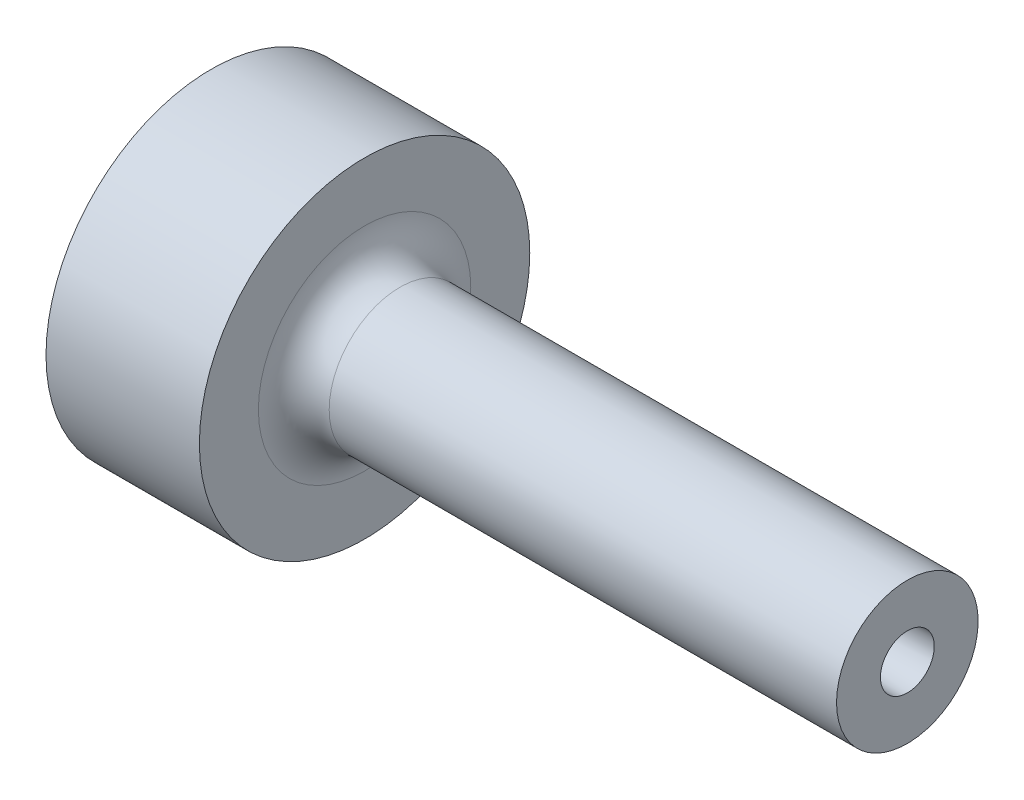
ISO-10303-21;
HEADER;
FILE_DESCRIPTION(('STEP AP214'),'2;1');
FILE_NAME('part.step','',(''),(''),'','','');
FILE_SCHEMA(('AUTOMOTIVE_DESIGN { 1 0 10303 214 1 1 1 1 }'));
ENDSEC;
DATA;
#1=APPLICATION_CONTEXT('core data for automotive mechanical design processes');
#2=APPLICATION_PROTOCOL_DEFINITION('international standard','automotive_design',2000,#1);
#3=PRODUCT_CONTEXT('',#1,'mechanical');
#4=PRODUCT('Part','Part','',(#3));
#5=PRODUCT_RELATED_PRODUCT_CATEGORY('part','',(#4));
#6=PRODUCT_DEFINITION_FORMATION('','',#4);
#7=PRODUCT_DEFINITION_CONTEXT('part definition',#1,'design');
#8=PRODUCT_DEFINITION('design','',#6,#7);
#9=PRODUCT_DEFINITION_SHAPE('','',#8);
#10=(LENGTH_UNIT() NAMED_UNIT(*) SI_UNIT(.MILLI.,.METRE.));
#11=(NAMED_UNIT(*) PLANE_ANGLE_UNIT() SI_UNIT($,.RADIAN.));
#12=(NAMED_UNIT(*) SI_UNIT($,.STERADIAN.) SOLID_ANGLE_UNIT());
#13=UNCERTAINTY_MEASURE_WITH_UNIT(LENGTH_MEASURE(1.E-05),#10,'distance_accuracy_value','');
#14=(GEOMETRIC_REPRESENTATION_CONTEXT(3) GLOBAL_UNCERTAINTY_ASSIGNED_CONTEXT((#13)) GLOBAL_UNIT_ASSIGNED_CONTEXT((#10,
#11,#12)) REPRESENTATION_CONTEXT('',''));
#15=CARTESIAN_POINT('',(0.,0.,0.));
#16=DIRECTION('',(0.,0.,1.));
#17=DIRECTION('',(1.,0.,0.));
#18=AXIS2_PLACEMENT_3D('',#15,#16,#17);
#19=CARTESIAN_POINT('',(0.,0.,0.));
#20=DIRECTION('',(-1.,0.,0.));
#21=DIRECTION('',(0.,0.,1.));
#22=AXIS2_PLACEMENT_3D('',#19,#20,#21);
#23=CYLINDRICAL_SURFACE('',#22,14.);
#24=CARTESIAN_POINT('',(13.,0.,0.));
#25=DIRECTION('',(-1.,0.,0.));
#26=DIRECTION('',(0.,0.,1.));
#27=AXIS2_PLACEMENT_3D('',#24,#25,#26);
#28=CIRCLE('',#27,14.);
#29=CARTESIAN_POINT('',(13.,0.,14.));
#30=VERTEX_POINT('',#29);
#31=EDGE_CURVE('E89',#30,#30,#28,.T.);
#32=ORIENTED_EDGE('',*,*,#31,.T.);
#33=EDGE_LOOP('',(#32));
#34=FACE_BOUND('',#33,.T.);
#35=CARTESIAN_POINT('',(0.,0.,0.));
#36=DIRECTION('',(-1.,0.,0.));
#37=DIRECTION('',(0.,0.,1.));
#38=AXIS2_PLACEMENT_3D('',#35,#36,#37);
#39=CIRCLE('',#38,14.);
#40=CARTESIAN_POINT('',(0.,0.,14.));
#41=VERTEX_POINT('',#40);
#42=EDGE_CURVE('E84',#41,#41,#39,.T.);
#43=ORIENTED_EDGE('',*,*,#42,.F.);
#44=EDGE_LOOP('',(#43));
#45=FACE_BOUND('',#44,.T.);
#46=CARTESIAN_POINT('',(6.5,-13.856406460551,-2.));
#47=CARTESIAN_POINT('',(6.61172417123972,-13.8564082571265,-1.99999534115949));
#48=CARTESIAN_POINT('',(6.72351471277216,-13.8577723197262,-1.99060664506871));
#49=CARTESIAN_POINT('',(6.9439746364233,-13.8630779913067,-1.95330740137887));
#50=CARTESIAN_POINT('',(7.05264079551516,-13.8670221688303,-1.92537839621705));
#51=CARTESIAN_POINT('',(7.26362870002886,-13.8770324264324,-1.85184738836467));
#52=CARTESIAN_POINT('',(7.36595507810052,-13.8830969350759,-1.80625847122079));
#53=CARTESIAN_POINT('',(7.56148972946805,-13.8966626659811,-1.69873175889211));
#54=CARTESIAN_POINT('',(7.65469934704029,-13.9041636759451,-1.63679637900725));
#55=CARTESIAN_POINT('',(7.83004829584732,-13.9198182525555,-1.49785346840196));
#56=CARTESIAN_POINT('',(7.91211171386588,-13.9279757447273,-1.42075056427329));
#57=CARTESIAN_POINT('',(8.06218155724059,-13.9439890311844,-1.25386707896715));
#58=CARTESIAN_POINT('',(8.13018723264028,-13.9518448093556,-1.16408582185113));
#59=CARTESIAN_POINT('',(8.25048909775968,-13.9664103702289,-0.973910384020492));
#60=CARTESIAN_POINT('',(8.30271571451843,-13.9731150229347,-0.873471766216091));
#61=CARTESIAN_POINT('',(8.38953073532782,-13.9845795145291,-0.665136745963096));
#62=CARTESIAN_POINT('',(8.4241199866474,-13.9893394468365,-0.557240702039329));
#63=CARTESIAN_POINT('',(8.47444920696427,-13.9963505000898,-0.337834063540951));
#64=CARTESIAN_POINT('',(8.49031606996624,-13.9986185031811,-0.226353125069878));
#65=CARTESIAN_POINT('',(8.5031438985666,-14.0004479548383,-0.00228956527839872));
#66=CARTESIAN_POINT('',(8.50010582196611,-14.0000095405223,0.110292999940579));
#67=CARTESIAN_POINT('',(8.47531062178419,-13.9964890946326,0.33249899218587));
#68=CARTESIAN_POINT('',(8.45369000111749,-13.9934263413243,0.442137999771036));
#69=CARTESIAN_POINT('',(8.39255744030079,-13.9850228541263,0.656215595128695));
#70=CARTESIAN_POINT('',(8.3530450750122,-13.9796820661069,0.760654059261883));
#71=CARTESIAN_POINT('',(8.25710925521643,-13.9672894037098,0.961781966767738));
#72=CARTESIAN_POINT('',(8.20062784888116,-13.9602316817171,1.05844339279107));
#73=CARTESIAN_POINT('',(8.07239950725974,-13.9451926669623,1.24096782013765));
#74=CARTESIAN_POINT('',(8.00065165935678,-13.9372113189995,1.32683017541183));
#75=CARTESIAN_POINT('',(7.843165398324,-13.921132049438,1.48612299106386));
#76=CARTESIAN_POINT('',(7.75730786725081,-13.9130337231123,1.55943569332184));
#77=CARTESIAN_POINT('',(7.57444547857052,-13.8977029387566,1.69062989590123));
#78=CARTESIAN_POINT('',(7.47744056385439,-13.890470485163,1.74851131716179));
#79=CARTESIAN_POINT('',(7.27491971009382,-13.8776905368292,1.84721301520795));
#80=CARTESIAN_POINT('',(7.1693981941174,-13.8721441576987,1.88802200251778));
#81=CARTESIAN_POINT('',(6.95290242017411,-13.8633846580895,1.9513062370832));
#82=CARTESIAN_POINT('',(6.84192850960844,-13.8601713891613,1.97378265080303));
#83=CARTESIAN_POINT('',(6.61872346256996,-13.8564698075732,1.99960390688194));
#84=CARTESIAN_POINT('',(6.50651197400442,-13.8559577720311,2.00311531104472));
#85=CARTESIAN_POINT('',(6.28310219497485,-13.8576537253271,1.9913480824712));
#86=CARTESIAN_POINT('',(6.17190387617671,-13.8598616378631,1.9760699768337));
#87=CARTESIAN_POINT('',(5.95418781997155,-13.8667269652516,1.92729837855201));
#88=CARTESIAN_POINT('',(5.84765127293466,-13.8713733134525,1.8938871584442));
#89=CARTESIAN_POINT('',(5.6416912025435,-13.8825829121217,1.80988306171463));
#90=CARTESIAN_POINT('',(5.54226800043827,-13.8891462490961,1.75928940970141));
#91=CARTESIAN_POINT('',(5.35260812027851,-13.9035064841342,1.64195360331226));
#92=CARTESIAN_POINT('',(5.26243903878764,-13.911311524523,1.57510320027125));
#93=CARTESIAN_POINT('',(5.09454027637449,-13.9272509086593,1.42730277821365));
#94=CARTESIAN_POINT('',(5.01681123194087,-13.9353852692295,1.34635203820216));
#95=CARTESIAN_POINT('',(4.8754047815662,-13.9511405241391,1.17191708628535));
#96=CARTESIAN_POINT('',(4.81183747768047,-13.9587570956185,1.07834317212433));
#97=CARTESIAN_POINT('',(4.70132443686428,-13.972552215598,0.881748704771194));
#98=CARTESIAN_POINT('',(4.65437828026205,-13.9787308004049,0.778728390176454));
#99=CARTESIAN_POINT('',(4.57861788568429,-13.9889347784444,0.566515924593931));
#100=CARTESIAN_POINT('',(4.54974241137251,-13.9929674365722,0.457345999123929));
#101=CARTESIAN_POINT('',(4.51074453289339,-13.9984555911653,0.235645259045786));
#102=CARTESIAN_POINT('',(4.50062101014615,-13.9999112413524,0.123114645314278));
#103=CARTESIAN_POINT('',(4.49943976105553,-14.0000800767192,-0.101043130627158));
#104=CARTESIAN_POINT('',(4.50821318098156,-13.998817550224,-0.212669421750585));
#105=CARTESIAN_POINT('',(4.54421615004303,-13.9937406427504,-0.432842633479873));
#106=CARTESIAN_POINT('',(4.57144565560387,-13.989926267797,-0.541389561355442));
#107=CARTESIAN_POINT('',(4.6435299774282,-13.9801722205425,-0.752283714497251));
#108=CARTESIAN_POINT('',(4.68837418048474,-13.9742338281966,-0.854634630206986));
#109=CARTESIAN_POINT('',(4.79439714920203,-13.960885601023,-1.05038570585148));
#110=CARTESIAN_POINT('',(4.8555763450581,-13.9534757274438,-1.14378562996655));
#111=CARTESIAN_POINT('',(4.99314771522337,-13.9379304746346,-1.31984194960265));
#112=CARTESIAN_POINT('',(5.06966490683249,-13.9297894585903,-1.40240016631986));
#113=CARTESIAN_POINT('',(5.2354775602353,-13.9137422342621,-1.55356716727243));
#114=CARTESIAN_POINT('',(5.32477602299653,-13.9058360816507,-1.6221726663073));
#115=CARTESIAN_POINT('',(5.51414543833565,-13.8911108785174,-1.74379523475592));
#116=CARTESIAN_POINT('',(5.61426869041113,-13.8842975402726,-1.79673154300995));
#117=CARTESIAN_POINT('',(5.82203229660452,-13.8725962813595,-1.88495902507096));
#118=CARTESIAN_POINT('',(5.92966459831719,-13.8677063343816,-1.92026877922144));
#119=CARTESIAN_POINT('',(6.11483642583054,-13.8615529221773,-1.96409255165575));
#120=CARTESIAN_POINT('',(6.19122433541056,-13.859633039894,-1.97753762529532));
#121=CARTESIAN_POINT('',(6.34506419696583,-13.857059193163,-1.99549291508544));
#122=CARTESIAN_POINT('',(6.42251613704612,-13.8564052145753,-2.00000323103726));
#123=CARTESIAN_POINT('',(6.5,-13.856406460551,-2.));
#124=B_SPLINE_CURVE_WITH_KNOTS('',3,(#46,#47,#48,#49,#50,#51,#52,#53,#54,#55,#56,#57,#58,#59,
#60,#61,#62,#63,#64,#65,#66,#67,#68,#69,#70,#71,#72,#73,#74,#75,#76,#77,#78,#79,#80,#81,#82,#83,
#84,#85,#86,#87,#88,#89,#90,#91,#92,#93,#94,#95,#96,#97,#98,#99,#100,#101,#102,#103,#104,#105,
#106,#107,#108,#109,#110,#111,#112,#113,#114,#115,#116,#117,#118,#119,#120,#121,#122,#123),
.UNSPECIFIED.,.T.,.F.,(4,2,2,2,2,2,2,2,2,2,2,2,2,2,2,2,2,2,2,2,2,2,2,2,2,2,2,2,2,2,2,2,2,2,2,2,
2,2,4),(0.,0.334889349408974,0.670112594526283,1.00508792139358,1.34001378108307,
1.6771171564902,2.01423851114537,2.35282530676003,2.6913958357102,3.02765822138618,
3.36390357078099,3.69769984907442,4.03150405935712,4.36646147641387,4.70143892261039,
5.03940517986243,5.37737316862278,5.7155642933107,6.05373389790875,6.3889286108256,
6.72411392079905,7.05779100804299,7.39148315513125,7.72746121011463,8.06345644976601,
8.40197921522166,8.74049343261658,9.07785422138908,9.41519488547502,9.74953375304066,
10.083871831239,10.4180087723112,10.7521545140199,11.0891434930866,11.426211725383,
11.7649881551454,12.103406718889,12.3356645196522,12.5679197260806),.UNSPECIFIED.);
#125=CARTESIAN_POINT('',(6.5,-13.856406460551,-2.));
#126=VERTEX_POINT('',#125);
#127=EDGE_CURVE('E10',#126,#126,#124,.T.);
#128=ORIENTED_EDGE('',*,*,#127,.F.);
#129=EDGE_LOOP('',(#128));
#130=FACE_BOUND('',#129,.T.);
#131=ADVANCED_FACE('F16',(#34,#45,#130),#23,.T.);
#132=CARTESIAN_POINT('',(0.,0.,0.));
#133=DIRECTION('',(1.,0.,0.));
#134=DIRECTION('',(0.,0.,-1.));
#135=AXIS2_PLACEMENT_3D('',#132,#133,#134);
#136=CONICAL_SURFACE('',#135,1.25,0.0174532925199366);
#137=CARTESIAN_POINT('',(59.,0.,0.));
#138=DIRECTION('',(-1.,0.,0.));
#139=DIRECTION('',(0.,0.,1.));
#140=AXIS2_PLACEMENT_3D('',#137,#138,#139);
#141=CIRCLE('',#140,2.27984883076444);
#142=CARTESIAN_POINT('',(59.,0.,2.27984883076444));
#143=VERTEX_POINT('',#142);
#144=EDGE_CURVE('E81',#143,#143,#141,.T.);
#145=ORIENTED_EDGE('',*,*,#144,.F.);
#146=EDGE_LOOP('',(#145));
#147=FACE_BOUND('',#146,.T.);
#148=CARTESIAN_POINT('',(0.924407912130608,0.,0.));
#149=DIRECTION('',(-1.,0.,0.));
#150=DIRECTION('',(0.,0.,1.));
#151=AXIS2_PLACEMENT_3D('',#148,#149,#150);
#152=CIRCLE('',#151,1.26613560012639);
#153=CARTESIAN_POINT('',(0.924407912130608,0.,1.26613560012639));
#154=VERTEX_POINT('',#153);
#155=EDGE_CURVE('E94',#154,#154,#152,.F.);
#156=ORIENTED_EDGE('',*,*,#155,.F.);
#157=EDGE_LOOP('',(#156));
#158=FACE_BOUND('',#157,.T.);
#159=ADVANCED_FACE('F45',(#147,#158),#136,.F.);
#160=CARTESIAN_POINT('',(16.,0.,0.));
#161=DIRECTION('',(-1.,0.,0.));
#162=DIRECTION('',(0.,0.,1.));
#163=AXIS2_PLACEMENT_3D('',#160,#161,#162);
#164=TOROIDAL_SURFACE('',#163,9.,3.);
#165=CARTESIAN_POINT('',(13.,0.,0.));
#166=DIRECTION('',(-1.,0.,0.));
#167=DIRECTION('',(0.,0.,1.));
#168=AXIS2_PLACEMENT_3D('',#165,#166,#167);
#169=CIRCLE('',#168,9.);
#170=CARTESIAN_POINT('',(13.,0.,9.));
#171=VERTEX_POINT('',#170);
#172=EDGE_CURVE('E91',#171,#171,#169,.T.);
#173=ORIENTED_EDGE('',*,*,#172,.F.);
#174=EDGE_LOOP('',(#173));
#175=FACE_BOUND('',#174,.T.);
#176=CARTESIAN_POINT('',(16.,0.,0.));
#177=DIRECTION('',(-1.,0.,0.));
#178=DIRECTION('',(0.,0.,1.));
#179=AXIS2_PLACEMENT_3D('',#176,#177,#178);
#180=CIRCLE('',#179,6.);
#181=CARTESIAN_POINT('',(16.,0.,6.));
#182=VERTEX_POINT('',#181);
#183=EDGE_CURVE('E28',#182,#182,#180,.T.);
#184=ORIENTED_EDGE('',*,*,#183,.T.);
#185=EDGE_LOOP('',(#184));
#186=FACE_BOUND('',#185,.T.);
#187=ADVANCED_FACE('F18',(#175,#186),#164,.F.);
#188=CARTESIAN_POINT('',(0.,0.,0.));
#189=DIRECTION('',(-1.,0.,0.));
#190=DIRECTION('',(0.,0.,1.));
#191=AXIS2_PLACEMENT_3D('',#188,#189,#190);
#192=CYLINDRICAL_SURFACE('',#191,6.);
#193=ORIENTED_EDGE('',*,*,#183,.F.);
#194=EDGE_LOOP('',(#193));
#195=FACE_BOUND('',#194,.T.);
#196=CARTESIAN_POINT('',(59.,0.,0.));
#197=DIRECTION('',(-1.,0.,0.));
#198=DIRECTION('',(0.,0.,1.));
#199=AXIS2_PLACEMENT_3D('',#196,#197,#198);
#200=CIRCLE('',#199,6.);
#201=CARTESIAN_POINT('',(59.,0.,6.));
#202=VERTEX_POINT('',#201);
#203=EDGE_CURVE('E80',#202,#202,#200,.T.);
#204=ORIENTED_EDGE('',*,*,#203,.T.);
#205=EDGE_LOOP('',(#204));
#206=FACE_BOUND('',#205,.T.);
#207=ADVANCED_FACE('F66',(#195,#206),#192,.T.);
#208=CARTESIAN_POINT('',(59.,6.,0.));
#209=DIRECTION('',(-1.,0.,0.));
#210=DIRECTION('',(0.,0.,1.));
#211=AXIS2_PLACEMENT_3D('',#208,#209,#210);
#212=PLANE('',#211);
#213=ORIENTED_EDGE('',*,*,#203,.F.);
#214=EDGE_LOOP('',(#213));
#215=FACE_BOUND('',#214,.T.);
#216=ORIENTED_EDGE('',*,*,#144,.T.);
#217=EDGE_LOOP('',(#216));
#218=FACE_BOUND('',#217,.T.);
#219=ADVANCED_FACE('F62',(#215,#218),#212,.F.);
#220=CARTESIAN_POINT('',(0.,1.25,0.));
#221=DIRECTION('',(1.,0.,0.));
#222=DIRECTION('',(0.,0.,-1.));
#223=AXIS2_PLACEMENT_3D('',#220,#221,#222);
#224=PLANE('',#223);
#225=CARTESIAN_POINT('',(0.,0.,0.));
#226=DIRECTION('',(-1.,0.,0.));
#227=DIRECTION('',(0.,0.,1.));
#228=AXIS2_PLACEMENT_3D('',#225,#226,#227);
#229=CIRCLE('',#228,5.);
#230=CARTESIAN_POINT('',(0.,0.,5.));
#231=VERTEX_POINT('',#230);
#232=EDGE_CURVE('E97',#231,#231,#229,.T.);
#233=ORIENTED_EDGE('',*,*,#232,.F.);
#234=EDGE_LOOP('',(#233));
#235=FACE_BOUND('',#234,.T.);
#236=ORIENTED_EDGE('',*,*,#42,.T.);
#237=EDGE_LOOP('',(#236));
#238=FACE_BOUND('',#237,.T.);
#239=ADVANCED_FACE('F60',(#235,#238),#224,.F.);
#240=CARTESIAN_POINT('',(13.,14.,0.));
#241=DIRECTION('',(-1.,0.,0.));
#242=DIRECTION('',(0.,0.,1.));
#243=AXIS2_PLACEMENT_3D('',#240,#241,#242);
#244=PLANE('',#243);
#245=ORIENTED_EDGE('',*,*,#31,.F.);
#246=EDGE_LOOP('',(#245));
#247=FACE_BOUND('',#246,.T.);
#248=ORIENTED_EDGE('',*,*,#172,.T.);
#249=EDGE_LOOP('',(#248));
#250=FACE_BOUND('',#249,.T.);
#251=ADVANCED_FACE('F58',(#247,#250),#244,.F.);
#252=CARTESIAN_POINT('',(-14.4672767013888,0.,0.));
#253=DIRECTION('',(-1.,0.,0.));
#254=DIRECTION('',(0.,0.,1.));
#255=AXIS2_PLACEMENT_3D('',#252,#253,#254);
#256=DEGENERATE_TOROIDAL_SURFACE('',#255,0.56308411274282,15.5,.F.);
#257=ORIENTED_EDGE('',*,*,#232,.T.);
#258=EDGE_LOOP('',(#257));
#259=FACE_BOUND('',#258,.T.);
#260=ORIENTED_EDGE('',*,*,#155,.T.);
#261=EDGE_LOOP('',(#260));
#262=FACE_BOUND('',#261,.T.);
#263=ADVANCED_FACE('F41',(#259,#262),#256,.T.);
#264=CARTESIAN_POINT('',(6.5,-14.,0.));
#265=DIRECTION('',(0.,-1.,0.));
#266=DIRECTION('',(0.,0.,-1.));
#267=AXIS2_PLACEMENT_3D('',#264,#265,#266);
#268=CYLINDRICAL_SURFACE('',#267,2.);
#269=CARTESIAN_POINT('',(6.5,-8.,0.));
#270=DIRECTION('',(0.,-1.,0.));
#271=DIRECTION('',(0.,0.,-1.));
#272=AXIS2_PLACEMENT_3D('',#269,#270,#271);
#273=CIRCLE('',#272,2.);
#274=CARTESIAN_POINT('',(6.5,-8.,-2.));
#275=VERTEX_POINT('',#274);
#276=EDGE_CURVE('E100',#275,#275,#273,.T.);
#277=ORIENTED_EDGE('',*,*,#276,.F.);
#278=EDGE_LOOP('',(#277));
#279=FACE_BOUND('',#278,.T.);
#280=ORIENTED_EDGE('',*,*,#127,.T.);
#281=EDGE_LOOP('',(#280));
#282=FACE_BOUND('',#281,.T.);
#283=ADVANCED_FACE('F33',(#279,#282),#268,.F.);
#284=CARTESIAN_POINT('',(6.5,-6.84529946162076,0.));
#285=DIRECTION('',(0.,-1.,0.));
#286=DIRECTION('',(0.,0.,-1.));
#287=AXIS2_PLACEMENT_3D('',#284,#285,#286);
#288=CONICAL_SURFACE('',#287,0.,1.0471975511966);
#289=ORIENTED_EDGE('',*,*,#276,.T.);
#290=EDGE_LOOP('',(#289));
#291=FACE_BOUND('',#290,.T.);
#292=CARTESIAN_POINT('',(6.5,-6.84529946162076,0.));
#293=VERTEX_POINT('',#292);
#294=VERTEX_LOOP('',#293);
#295=FACE_BOUND('',#294,.T.);
#296=ADVANCED_FACE('F31',(#291,#295),#288,.F.);
#297=CLOSED_SHELL('',(#131,#159,#187,#207,#219,#239,#251,#263,#283,#296));
#298=MANIFOLD_SOLID_BREP('B1',#297);
#299=ADVANCED_BREP_SHAPE_REPRESENTATION('',(#18,#298),#14);
#300=SHAPE_DEFINITION_REPRESENTATION(#9,#299);
ENDSEC;
END-ISO-10303-21;
